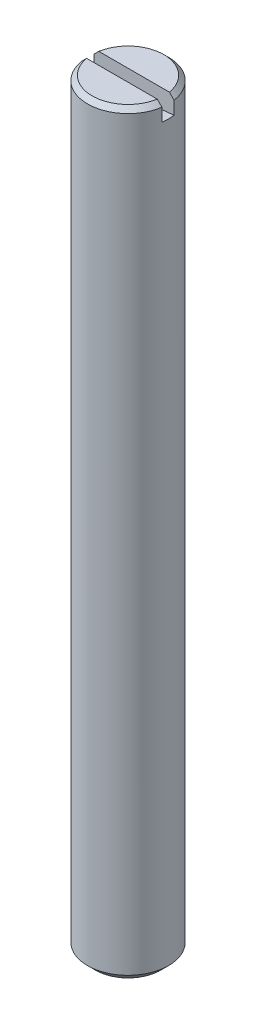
ISO-10303-21;
HEADER;
FILE_DESCRIPTION(('STEP AP214'),'2;1');
FILE_NAME('part.step','',(''),(''),'','','');
FILE_SCHEMA(('AUTOMOTIVE_DESIGN { 1 0 10303 214 1 1 1 1 }'));
ENDSEC;
DATA;
#1=APPLICATION_CONTEXT('core data for automotive mechanical design processes');
#2=APPLICATION_PROTOCOL_DEFINITION('international standard','automotive_design',2000,#1);
#3=PRODUCT_CONTEXT('',#1,'mechanical');
#4=PRODUCT('Part','Part','',(#3));
#5=PRODUCT_RELATED_PRODUCT_CATEGORY('part','',(#4));
#6=PRODUCT_DEFINITION_FORMATION('','',#4);
#7=PRODUCT_DEFINITION_CONTEXT('part definition',#1,'design');
#8=PRODUCT_DEFINITION('design','',#6,#7);
#9=PRODUCT_DEFINITION_SHAPE('','',#8);
#10=(LENGTH_UNIT() NAMED_UNIT(*) SI_UNIT(.MILLI.,.METRE.));
#11=(NAMED_UNIT(*) PLANE_ANGLE_UNIT() SI_UNIT($,.RADIAN.));
#12=(NAMED_UNIT(*) SI_UNIT($,.STERADIAN.) SOLID_ANGLE_UNIT());
#13=UNCERTAINTY_MEASURE_WITH_UNIT(LENGTH_MEASURE(1.E-05),#10,'distance_accuracy_value','');
#14=(GEOMETRIC_REPRESENTATION_CONTEXT(3) GLOBAL_UNCERTAINTY_ASSIGNED_CONTEXT((#13)) GLOBAL_UNIT_ASSIGNED_CONTEXT((#10,
#11,#12)) REPRESENTATION_CONTEXT('',''));
#15=CARTESIAN_POINT('',(0.,0.,0.));
#16=DIRECTION('',(0.,0.,1.));
#17=DIRECTION('',(1.,0.,0.));
#18=AXIS2_PLACEMENT_3D('',#15,#16,#17);
#19=CARTESIAN_POINT('',(0.,50.,0.));
#20=DIRECTION('',(0.,-1.,0.));
#21=DIRECTION('',(0.,0.,-1.));
#22=AXIS2_PLACEMENT_3D('',#19,#20,#21);
#23=PLANE('',#22);
#24=CARTESIAN_POINT('',(0.,50.0000000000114,0.));
#25=DIRECTION('',(0.,-1.,0.));
#26=DIRECTION('',(0.,0.,-1.));
#27=AXIS2_PLACEMENT_3D('',#24,#25,#26);
#28=CIRCLE('',#27,3.53999999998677);
#29=CARTESIAN_POINT('',(-3.48878202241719,50.0000000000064,-0.6));
#30=VERTEX_POINT('',#29);
#31=CARTESIAN_POINT('',(3.48878202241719,50.0000000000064,-0.6));
#32=VERTEX_POINT('',#31);
#33=EDGE_CURVE('E87',#30,#32,#28,.T.);
#34=ORIENTED_EDGE('',*,*,#33,.F.);
#35=DIRECTION('',(1.,0.,0.));
#36=VECTOR('',#35,1.);
#37=CARTESIAN_POINT('',(0.,50.,-0.6));
#38=LINE('',#37,#36);
#39=EDGE_CURVE('E19',#32,#30,#38,.F.);
#40=ORIENTED_EDGE('',*,*,#39,.F.);
#41=EDGE_LOOP('',(#34,#40));
#42=FACE_BOUND('',#41,.T.);
#43=ADVANCED_FACE('F14',(#42),#23,.F.);
#44=CARTESIAN_POINT('',(0.,50.,0.));
#45=DIRECTION('',(0.,-1.,0.));
#46=DIRECTION('',(0.,0.,-1.));
#47=AXIS2_PLACEMENT_3D('',#44,#45,#46);
#48=PLANE('',#47);
#49=DIRECTION('',(1.,0.,0.));
#50=VECTOR('',#49,1.);
#51=CARTESIAN_POINT('',(0.,50.,0.6));
#52=LINE('',#51,#50);
#53=CARTESIAN_POINT('',(-3.48878202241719,50.0000000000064,0.6));
#54=VERTEX_POINT('',#53);
#55=CARTESIAN_POINT('',(3.48878202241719,50.0000000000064,0.6));
#56=VERTEX_POINT('',#55);
#57=EDGE_CURVE('E81',#54,#56,#52,.T.);
#58=ORIENTED_EDGE('',*,*,#57,.F.);
#59=CARTESIAN_POINT('',(0.,50.0000000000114,0.));
#60=DIRECTION('',(0.,-1.,0.));
#61=DIRECTION('',(0.,0.,-1.));
#62=AXIS2_PLACEMENT_3D('',#59,#60,#61);
#63=CIRCLE('',#62,3.53999999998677);
#64=EDGE_CURVE('E74',#56,#54,#63,.T.);
#65=ORIENTED_EDGE('',*,*,#64,.F.);
#66=EDGE_LOOP('',(#58,#65));
#67=FACE_BOUND('',#66,.T.);
#68=ADVANCED_FACE('F86',(#67),#48,.F.);
#69=CARTESIAN_POINT('',(0.,49.5399999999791,0.));
#70=DIRECTION('',(0.,-1.,0.));
#71=DIRECTION('',(0.,0.,-1.));
#72=AXIS2_PLACEMENT_3D('',#69,#70,#71);
#73=CONICAL_SURFACE('',#72,3.99999999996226,0.785398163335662);
#74=CARTESIAN_POINT('',(-3.48878202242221,50.0000000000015,-0.6));
#75=CARTESIAN_POINT('',(-3.56650335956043,49.9233951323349,-0.6));
#76=CARTESIAN_POINT('',(-3.64419419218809,49.8467593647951,-0.6));
#77=CARTESIAN_POINT('',(-3.79951484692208,49.6934260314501,-0.6));
#78=CARTESIAN_POINT('',(-3.87714466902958,49.6167284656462,-0.6));
#79=CARTESIAN_POINT('',(-3.9547439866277,49.5399999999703,-0.6));
#80=B_SPLINE_CURVE_WITH_KNOTS('',3,(#74,#75,#76,#77,#78,#79),.UNSPECIFIED.,.F.,.F.,(4,2,4),(0.,
0.327383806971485,0.654767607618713),.UNSPECIFIED.);
#81=CARTESIAN_POINT('',(-3.95474398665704,49.5399999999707,-0.6));
#82=VERTEX_POINT('',#81);
#83=EDGE_CURVE('E85',#30,#82,#80,.T.);
#84=ORIENTED_EDGE('',*,*,#83,.F.);
#85=ORIENTED_EDGE('',*,*,#33,.T.);
#86=CARTESIAN_POINT('',(3.95474398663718,49.5399999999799,-0.600000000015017));
#87=CARTESIAN_POINT('',(3.87714466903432,49.616728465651,-0.600000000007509));
#88=CARTESIAN_POINT('',(3.79951484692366,49.6934260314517,-0.600000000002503));
#89=CARTESIAN_POINT('',(3.64419419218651,49.8467593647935,-0.599999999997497));
#90=CARTESIAN_POINT('',(3.56650335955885,49.9233951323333,-0.599999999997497));
#91=CARTESIAN_POINT('',(3.48878202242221,50.0000000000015,-0.6));
#92=B_SPLINE_CURVE_WITH_KNOTS('',3,(#86,#87,#88,#89,#90,#91),.UNSPECIFIED.,.F.,.F.,(4,2,4),(0.,
0.327383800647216,0.654767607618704),.UNSPECIFIED.);
#93=CARTESIAN_POINT('',(3.95474398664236,49.5399999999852,-0.6));
#94=VERTEX_POINT('',#93);
#95=EDGE_CURVE('E112',#94,#32,#92,.T.);
#96=ORIENTED_EDGE('',*,*,#95,.F.);
#97=CARTESIAN_POINT('',(0.,49.54,0.));
#98=DIRECTION('',(0.,-1.,0.));
#99=DIRECTION('',(0.,0.,-1.));
#100=AXIS2_PLACEMENT_3D('',#97,#98,#99);
#101=CIRCLE('',#100,4.);
#102=EDGE_CURVE('E101',#82,#94,#101,.T.);
#103=ORIENTED_EDGE('',*,*,#102,.F.);
#104=EDGE_LOOP('',(#84,#85,#96,#103));
#105=FACE_BOUND('',#104,.T.);
#106=ADVANCED_FACE('F128',(#105),#73,.T.);
#107=CARTESIAN_POINT('',(0.,79.5,-0.6));
#108=DIRECTION('',(0.,0.,1.));
#109=DIRECTION('',(1.,0.,0.));
#110=AXIS2_PLACEMENT_3D('',#107,#108,#109);
#111=PLANE('',#110);
#112=ORIENTED_EDGE('',*,*,#39,.T.);
#113=ORIENTED_EDGE('',*,*,#83,.T.);
#114=DIRECTION('',(0.,1.,0.));
#115=VECTOR('',#114,1.);
#116=CARTESIAN_POINT('',(-3.95474398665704,79.5,-0.6));
#117=LINE('',#116,#115);
#118=CARTESIAN_POINT('',(-3.95474398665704,48.2492400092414,-0.6));
#119=VERTEX_POINT('',#118);
#120=EDGE_CURVE('E58',#82,#119,#117,.F.);
#121=ORIENTED_EDGE('',*,*,#120,.T.);
#122=CARTESIAN_POINT('',(0.,79.5,-0.6));
#123=DIRECTION('',(0.,0.,-1.));
#124=DIRECTION('',(-1.,0.,0.));
#125=AXIS2_PLACEMENT_3D('',#122,#123,#124);
#126=CIRCLE('',#125,31.5);
#127=CARTESIAN_POINT('',(3.95474398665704,48.2492400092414,-0.6));
#128=VERTEX_POINT('',#127);
#129=EDGE_CURVE('E109',#119,#128,#126,.F.);
#130=ORIENTED_EDGE('',*,*,#129,.T.);
#131=DIRECTION('',(0.,1.,0.));
#132=VECTOR('',#131,1.);
#133=CARTESIAN_POINT('',(3.95474398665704,79.5,-0.6));
#134=LINE('',#133,#132);
#135=EDGE_CURVE('E110',#128,#94,#134,.T.);
#136=ORIENTED_EDGE('',*,*,#135,.T.);
#137=ORIENTED_EDGE('',*,*,#95,.T.);
#138=EDGE_LOOP('',(#112,#113,#121,#130,#136,#137));
#139=FACE_BOUND('',#138,.T.);
#140=ADVANCED_FACE('F124',(#139),#111,.T.);
#141=CARTESIAN_POINT('',(0.,49.5399999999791,0.));
#142=DIRECTION('',(0.,-1.,0.));
#143=DIRECTION('',(0.,0.,-1.));
#144=AXIS2_PLACEMENT_3D('',#141,#142,#143);
#145=CONICAL_SURFACE('',#144,3.99999999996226,0.785398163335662);
#146=ORIENTED_EDGE('',*,*,#64,.T.);
#147=CARTESIAN_POINT('',(-3.48878202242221,50.0000000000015,0.6));
#148=CARTESIAN_POINT('',(-3.56650335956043,49.9233951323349,0.6));
#149=CARTESIAN_POINT('',(-3.64419419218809,49.8467593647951,0.6));
#150=CARTESIAN_POINT('',(-3.79951484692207,49.6934260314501,0.6));
#151=CARTESIAN_POINT('',(-3.87714466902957,49.6167284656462,0.6));
#152=CARTESIAN_POINT('',(-3.95474398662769,49.5399999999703,0.6));
#153=B_SPLINE_CURVE_WITH_KNOTS('',3,(#147,#148,#149,#150,#151,#152),.UNSPECIFIED.,.F.,.F.,(4,2,
4),(0.,0.327383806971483,0.654767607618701),.UNSPECIFIED.);
#154=CARTESIAN_POINT('',(-3.95474398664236,49.5399999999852,0.6));
#155=VERTEX_POINT('',#154);
#156=EDGE_CURVE('E34',#54,#155,#153,.T.);
#157=ORIENTED_EDGE('',*,*,#156,.T.);
#158=CARTESIAN_POINT('',(0.,49.54,0.));
#159=DIRECTION('',(0.,-1.,0.));
#160=DIRECTION('',(0.,0.,-1.));
#161=AXIS2_PLACEMENT_3D('',#158,#159,#160);
#162=CIRCLE('',#161,4.);
#163=CARTESIAN_POINT('',(3.95474398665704,49.5399999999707,0.6));
#164=VERTEX_POINT('',#163);
#165=EDGE_CURVE('E75',#164,#155,#162,.T.);
#166=ORIENTED_EDGE('',*,*,#165,.F.);
#167=CARTESIAN_POINT('',(3.95474398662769,49.5399999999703,0.6));
#168=CARTESIAN_POINT('',(3.87714466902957,49.6167284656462,0.6));
#169=CARTESIAN_POINT('',(3.79951484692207,49.6934260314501,0.6));
#170=CARTESIAN_POINT('',(3.64419419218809,49.8467593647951,0.6));
#171=CARTESIAN_POINT('',(3.56650335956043,49.9233951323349,0.6));
#172=CARTESIAN_POINT('',(3.48878202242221,50.0000000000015,0.6));
#173=B_SPLINE_CURVE_WITH_KNOTS('',3,(#167,#168,#169,#170,#171,#172),.UNSPECIFIED.,.F.,.F.,(4,2,
4),(0.,0.327383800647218,0.654767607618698),.UNSPECIFIED.);
#174=EDGE_CURVE('E70',#164,#56,#173,.T.);
#175=ORIENTED_EDGE('',*,*,#174,.T.);
#176=EDGE_LOOP('',(#146,#157,#166,#175));
#177=FACE_BOUND('',#176,.T.);
#178=ADVANCED_FACE('F72',(#177),#145,.T.);
#179=CARTESIAN_POINT('',(0.,79.5,0.6));
#180=DIRECTION('',(0.,0.,1.));
#181=DIRECTION('',(1.,0.,0.));
#182=AXIS2_PLACEMENT_3D('',#179,#180,#181);
#183=PLANE('',#182);
#184=ORIENTED_EDGE('',*,*,#57,.T.);
#185=ORIENTED_EDGE('',*,*,#174,.F.);
#186=DIRECTION('',(0.,1.,0.));
#187=VECTOR('',#186,1.);
#188=CARTESIAN_POINT('',(3.95474398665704,79.5,0.6));
#189=LINE('',#188,#187);
#190=CARTESIAN_POINT('',(3.95474398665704,48.2492400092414,0.6));
#191=VERTEX_POINT('',#190);
#192=EDGE_CURVE('E78',#191,#164,#189,.T.);
#193=ORIENTED_EDGE('',*,*,#192,.F.);
#194=CARTESIAN_POINT('',(0.,79.5,0.6));
#195=DIRECTION('',(0.,0.,-1.));
#196=DIRECTION('',(-1.,0.,0.));
#197=AXIS2_PLACEMENT_3D('',#194,#195,#196);
#198=CIRCLE('',#197,31.5);
#199=CARTESIAN_POINT('',(-3.95474398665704,48.2492400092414,0.6));
#200=VERTEX_POINT('',#199);
#201=EDGE_CURVE('E106',#200,#191,#198,.F.);
#202=ORIENTED_EDGE('',*,*,#201,.F.);
#203=DIRECTION('',(0.,1.,0.));
#204=VECTOR('',#203,1.);
#205=CARTESIAN_POINT('',(-3.95474398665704,79.5,0.6));
#206=LINE('',#205,#204);
#207=EDGE_CURVE('E104',#155,#200,#206,.F.);
#208=ORIENTED_EDGE('',*,*,#207,.F.);
#209=ORIENTED_EDGE('',*,*,#156,.F.);
#210=EDGE_LOOP('',(#184,#185,#193,#202,#208,#209));
#211=FACE_BOUND('',#210,.T.);
#212=ADVANCED_FACE('F82',(#211),#183,.F.);
#213=CARTESIAN_POINT('',(0.,79.5,0.6));
#214=DIRECTION('',(0.,0.,-1.));
#215=DIRECTION('',(-1.,0.,0.));
#216=AXIS2_PLACEMENT_3D('',#213,#214,#215);
#217=CYLINDRICAL_SURFACE('',#216,31.5);
#218=CARTESIAN_POINT('',(3.95474398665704,48.2492400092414,-0.6));
#219=CARTESIAN_POINT('',(3.96984984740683,48.2511544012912,-0.500484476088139));
#220=CARTESIAN_POINT('',(3.98118553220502,48.2525972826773,-0.40038868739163));
#221=CARTESIAN_POINT('',(3.9962389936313,48.2545175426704,-0.20019306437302));
#222=CARTESIAN_POINT('',(4.,48.2550004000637,-0.10009653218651));
#223=CARTESIAN_POINT('',(4.,48.2550004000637,0.10009653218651));
#224=CARTESIAN_POINT('',(3.9962389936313,48.2545175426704,0.20019306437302));
#225=CARTESIAN_POINT('',(3.98118553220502,48.2525972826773,0.40038868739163));
#226=CARTESIAN_POINT('',(3.96984984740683,48.2511544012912,0.500484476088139));
#227=CARTESIAN_POINT('',(3.95474398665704,48.2492400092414,0.6));
#228=B_SPLINE_CURVE_WITH_KNOTS('',3,(#218,#219,#220,#221,#222,#223,#224,#225,#226,#227),
.UNSPECIFIED.,.F.,.F.,(4,2,2,2,4),(0.,0.301946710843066,0.602165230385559,0.902383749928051,
1.20433046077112),.UNSPECIFIED.);
#229=EDGE_CURVE('E25',#128,#191,#228,.T.);
#230=ORIENTED_EDGE('',*,*,#229,.F.);
#231=ORIENTED_EDGE('',*,*,#129,.F.);
#232=CARTESIAN_POINT('',(-3.95474398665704,48.2492400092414,0.6));
#233=CARTESIAN_POINT('',(-3.96984984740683,48.2511544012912,0.500484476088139));
#234=CARTESIAN_POINT('',(-3.98118553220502,48.2525972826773,0.40038868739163));
#235=CARTESIAN_POINT('',(-3.9962389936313,48.2545175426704,0.20019306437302));
#236=CARTESIAN_POINT('',(-4.,48.2550004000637,0.10009653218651));
#237=CARTESIAN_POINT('',(-4.,48.2550004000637,-0.10009653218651));
#238=CARTESIAN_POINT('',(-3.9962389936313,48.2545175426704,-0.20019306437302));
#239=CARTESIAN_POINT('',(-3.98118553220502,48.2525972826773,-0.40038868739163));
#240=CARTESIAN_POINT('',(-3.96984984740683,48.2511544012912,-0.500484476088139));
#241=CARTESIAN_POINT('',(-3.95474398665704,48.2492400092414,-0.6));
#242=B_SPLINE_CURVE_WITH_KNOTS('',3,(#232,#233,#234,#235,#236,#237,#238,#239,#240,#241),
.UNSPECIFIED.,.F.,.F.,(4,2,2,2,4),(0.,0.301946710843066,0.602165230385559,0.902383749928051,
1.20433046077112),.UNSPECIFIED.);
#243=EDGE_CURVE('E9',#200,#119,#242,.T.);
#244=ORIENTED_EDGE('',*,*,#243,.F.);
#245=ORIENTED_EDGE('',*,*,#201,.T.);
#246=EDGE_LOOP('',(#230,#231,#244,#245));
#247=FACE_BOUND('',#246,.T.);
#248=ADVANCED_FACE('F151',(#247),#217,.F.);
#249=CARTESIAN_POINT('',(0.,37.5,0.));
#250=DIRECTION('',(0.,-1.,0.));
#251=DIRECTION('',(0.,0.,-1.));
#252=AXIS2_PLACEMENT_3D('',#249,#250,#251);
#253=CYLINDRICAL_SURFACE('',#252,4.);
#254=ORIENTED_EDGE('',*,*,#229,.T.);
#255=ORIENTED_EDGE('',*,*,#192,.T.);
#256=ORIENTED_EDGE('',*,*,#165,.T.);
#257=ORIENTED_EDGE('',*,*,#207,.T.);
#258=ORIENTED_EDGE('',*,*,#243,.T.);
#259=ORIENTED_EDGE('',*,*,#120,.F.);
#260=ORIENTED_EDGE('',*,*,#102,.T.);
#261=ORIENTED_EDGE('',*,*,#135,.F.);
#262=EDGE_LOOP('',(#254,#255,#256,#257,#258,#259,#260,#261));
#263=FACE_BOUND('',#262,.T.);
#264=CARTESIAN_POINT('',(0.,-24.233,0.));
#265=DIRECTION('',(0.,-1.,0.));
#266=DIRECTION('',(0.,0.,-1.));
#267=AXIS2_PLACEMENT_3D('',#264,#265,#266);
#268=CIRCLE('',#267,4.);
#269=CARTESIAN_POINT('',(0.,-24.233,-4.));
#270=VERTEX_POINT('',#269);
#271=EDGE_CURVE('E103',#270,#270,#268,.T.);
#272=ORIENTED_EDGE('',*,*,#271,.F.);
#273=EDGE_LOOP('',(#272));
#274=FACE_BOUND('',#273,.T.);
#275=ADVANCED_FACE('F16',(#263,#274),#253,.T.);
#276=CARTESIAN_POINT('',(3.233,-25.,0.));
#277=DIRECTION('',(0.,1.,0.));
#278=DIRECTION('',(0.,0.,1.));
#279=AXIS2_PLACEMENT_3D('',#276,#277,#278);
#280=PLANE('',#279);
#281=CARTESIAN_POINT('',(0.,-25.,0.));
#282=DIRECTION('',(0.,1.,0.));
#283=DIRECTION('',(-1.,0.,0.));
#284=AXIS2_PLACEMENT_3D('',#281,#282,#283);
#285=CIRCLE('',#284,3.23299999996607);
#286=CARTESIAN_POINT('',(-3.23299999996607,-25.,0.));
#287=VERTEX_POINT('',#286);
#288=EDGE_CURVE('E171',#287,#287,#285,.T.);
#289=ORIENTED_EDGE('',*,*,#288,.F.);
#290=EDGE_LOOP('',(#289));
#291=FACE_BOUND('',#290,.T.);
#292=ADVANCED_FACE('F157',(#291),#280,.F.);
#293=CARTESIAN_POINT('',(0.,-24.232999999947,0.));
#294=DIRECTION('',(0.,1.,0.));
#295=DIRECTION('',(-1.,0.,0.));
#296=AXIS2_PLACEMENT_3D('',#293,#294,#295);
#297=CONICAL_SURFACE('',#296,4.0000000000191,0.785398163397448);
#298=ORIENTED_EDGE('',*,*,#271,.T.);
#299=EDGE_LOOP('',(#298));
#300=FACE_BOUND('',#299,.T.);
#301=ORIENTED_EDGE('',*,*,#288,.T.);
#302=EDGE_LOOP('',(#301));
#303=FACE_BOUND('',#302,.T.);
#304=ADVANCED_FACE('F177',(#300,#303),#297,.T.);
#305=CLOSED_SHELL('',(#43,#68,#106,#140,#178,#212,#248,#275,#292,#304));
#306=MANIFOLD_SOLID_BREP('B1',#305);
#307=ADVANCED_BREP_SHAPE_REPRESENTATION('',(#18,#306),#14);
#308=SHAPE_DEFINITION_REPRESENTATION(#9,#307);
ENDSEC;
END-ISO-10303-21;
